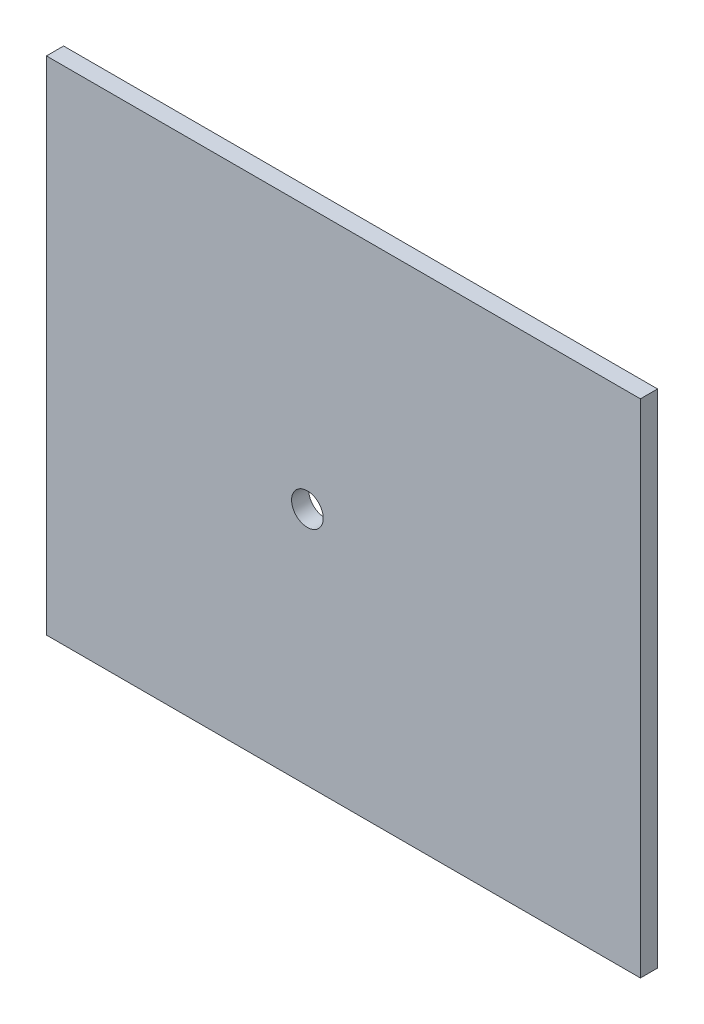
from build123d import *

# Parameters (mm, degrees)
ESQUISSE1_W             = 45
ESQUISSE1_H             = 38
EXTRUSION1_DEPTH        = 1.3
ESQUISSE2_R             = 1.2
ENL_V_MAT_EXTRU_1_DEPTH = 59.912562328


with BuildPart() as part:
    # Esquisse1 → Extrusion1 (new body)
    with BuildSketch(Plane.XY):
        with Locations((22.5, 19)):
            Rectangle(ESQUISSE1_W, ESQUISSE1_H)
    extrude(amount=EXTRUSION1_DEPTH)

    # Esquisse2 → Enl_v. mat.-Extru.1 (cut, through all)
    with BuildSketch(Plane.XY.offset(1.3)):
        with Locations((19.770769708, 18.147982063)):
            Circle(ESQUISSE2_R)
    extrude(amount=-ENL_V_MAT_EXTRU_1_DEPTH, mode=Mode.SUBTRACT)


solid = part.part
